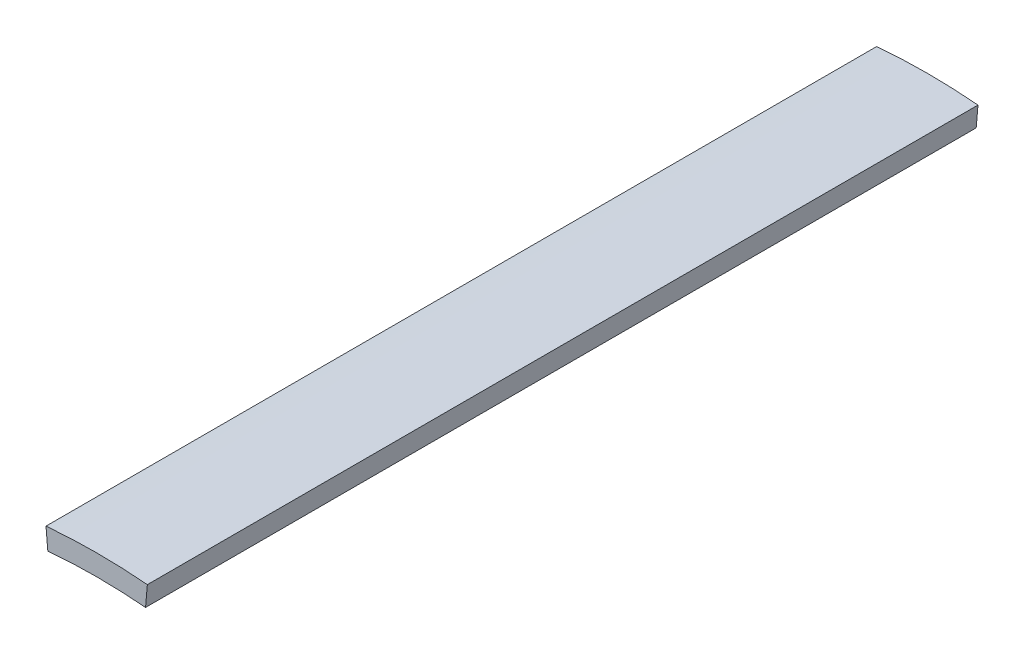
from build123d import *

# Parameters (mm, degrees)
BOSS_EXTRU_1_DEPTH = 10


with BuildPart() as part:
    # Esquisse1 → Boss.-Extru.1 (new body)
    with BuildSketch(Plane.XY):
        with BuildLine():
            Line((-0.588301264, 6.724314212), (-0.610090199, 6.973362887))
            ThreePointArc((-0.610090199, 6.973362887), (0, 7), (0.610090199, 6.973362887))
            Line((0.610090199, 6.973362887), (0.588301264, 6.724314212))
            ThreePointArc((0.588301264, 6.724314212), (0, 6.75), (-0.588301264, 6.724314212))
        make_face()
    extrude(amount=BOSS_EXTRU_1_DEPTH)


solid = part.part
